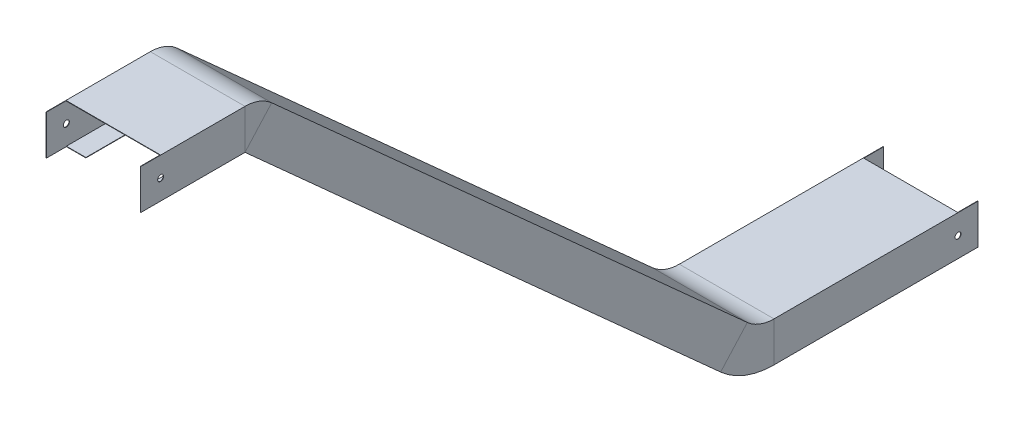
from build123d import *

# Parameters (mm, degrees)
SKETCH7_W           = 200
SKETCH7_H           = 400
BOSS_EXTRUDE1_DEPTH = 4
SKETCH8_R           = 30
CUT_EXTRUDE1_DEPTH  = 4
SKETCH9_W           = 200
SKETCH9_H           = 400
BOSS_EXTRUDE2_DEPTH = 4
SKETCH11_R          = 30
CUT_EXTRUDE2_DEPTH  = 4


with BuildPart() as part:
    # Sweep1: sweep along a path in Sketch1
    with BuildLine(Plane(origin=(0, 0, 0), x_dir=(0, 0, -1), z_dir=(1, 0, 0))) as sweep1_path:
        Line((4000, -2250), (2153.494402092, -2250))
        ThreePointArc((2153.494402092, -2250), (2010.188895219, -2223.448164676), (1885.908509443, -2147.317658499))
        Line((1885.908509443, -2147.317658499), (-2885.908509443, 2147.317658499))
        ThreePointArc((-2885.908509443, 2147.317658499), (-3010.188895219, 2223.448164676), (-3153.494402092, 2250))
        Line((-3153.494402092, 2250), (-4000, 2250))
    # Sketch5 → Sweep1 (sweep)
    with BuildSketch(Plane.XY.offset(-4000)):
        Polygon((-475, -2250), (475, -2250), (475, -2650), (275, -2650), (275, -2646), (471, -2646), (471, -2254), (-471, -2254), (-471, -2646), (-275, -2646), (-275, -2650), (-475, -2650), align=None)
    sweep(path=sweep1_path.line)

    # Sketch7 → Boss-Extrude1 (add)
    with BuildSketch(Plane(origin=(475, 0, 0), x_dir=(0, 0, -1), z_dir=(1, 0, 0))):
        with Locations((-4100, 2050)):
            Rectangle(SKETCH7_W, SKETCH7_H)
    boss_extrude1 = extrude(amount=-BOSS_EXTRUDE1_DEPTH)

    # Mirror1: Boss-Extrude1 across plane
    add(boss_extrude1.mirror(Plane(origin=(0, 0, 0), x_dir=(0, 0, 1), z_dir=(1, 0, 0))))

    # Sketch8 → Cut-Extrude1 (cut)
    with BuildSketch(Plane(origin=(475, 0, 0), x_dir=(0, 0, -1), z_dir=(1, 0, 0))):
        with Locations((-4000, 2050)):
            Circle(SKETCH8_R)
    cut_extrude1 = extrude(amount=-CUT_EXTRUDE1_DEPTH, mode=Mode.SUBTRACT)

    # Mirror2: Cut-Extrude1 across plane
    add(cut_extrude1.mirror(Plane(origin=(0, 0, 0), x_dir=(0, 0, 1), z_dir=(1, 0, 0))), mode=Mode.SUBTRACT)

    # Sketch9 → Boss-Extrude2 (add)
    with BuildSketch(Plane(origin=(475, 0, 0), x_dir=(0, 0, -1), z_dir=(1, 0, 0))):
        with Locations((4100, -2450)):
            Rectangle(SKETCH9_W, SKETCH9_H)
    boss_extrude2 = extrude(amount=-BOSS_EXTRUDE2_DEPTH)

    # Mirror3: Boss-Extrude2 across plane
    add(boss_extrude2.mirror(Plane(origin=(0, 0, 0), x_dir=(0, 0, 1), z_dir=(1, 0, 0))))

    # Sketch11 → Cut-Extrude2 (cut)
    with BuildSketch(Plane(origin=(475, 0, 0), x_dir=(0, 0, -1), z_dir=(1, 0, 0))):
        with Locations((4000, -2450)):
            Circle(SKETCH11_R)
    cut_extrude2 = extrude(amount=-CUT_EXTRUDE2_DEPTH, mode=Mode.SUBTRACT)

    # Mirror4: Cut-Extrude2 across plane
    add(cut_extrude2.mirror(Plane(origin=(0, 0, 0), x_dir=(0, 0, 1), z_dir=(1, 0, 0))), mode=Mode.SUBTRACT)


solid = part.part
